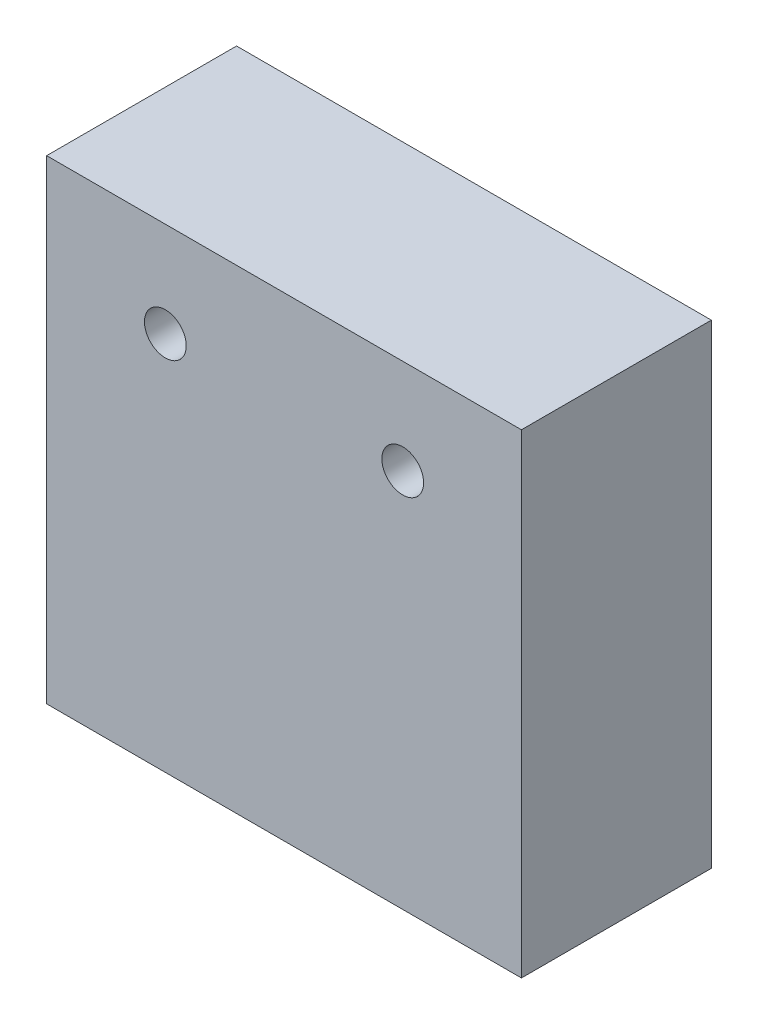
from build123d import *

# Parameters (mm, degrees)
SKETCH2_R                       = 1.397
BOSS_EXTRUDE1_DEPTH             = 6.35
F_1_4_0_25_DIAMETER_HOLE1_D     = 6.35
F_1_4_0_25_DIAMETER_HOLE1_DEPTH = 20.32
F_1_4_0_25_DIAMETER_HOLE1_TIP   = 1.907732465


with BuildPart() as part:
    # Sketch2 → Boss-Extrude1 (new, symmetric)
    with BuildSketch(Plane.XY):
        Polygon((-15.875, 31.75), (-15.875, 0), (0, 0), (15.875, 0), (15.875, 31.75), align=None)
        with Locations((-7.9375, 25.4)):
            Circle(SKETCH2_R, mode=Mode.SUBTRACT)
        with Locations((7.9375, 25.4)):
            Circle(SKETCH2_R, mode=Mode.SUBTRACT)
    extrude(amount=BOSS_EXTRUDE1_DEPTH, both=True)

    # 1_4 _0.25_ Diameter Hole1
    with Locations(Plane(origin=(0, 0, 0), x_dir=(-1, 0, 0), z_dir=(0, -1, 0))):
        with Locations((9.525, 0), (-9.525, 0)):
            Hole(F_1_4_0_25_DIAMETER_HOLE1_D / 2, depth=F_1_4_0_25_DIAMETER_HOLE1_DEPTH)
            with Locations((0, 0, -(F_1_4_0_25_DIAMETER_HOLE1_DEPTH + F_1_4_0_25_DIAMETER_HOLE1_TIP / 2))):  # 118° drill point
                Cone(0, F_1_4_0_25_DIAMETER_HOLE1_D / 2, F_1_4_0_25_DIAMETER_HOLE1_TIP, mode=Mode.SUBTRACT)


solid = part.part
